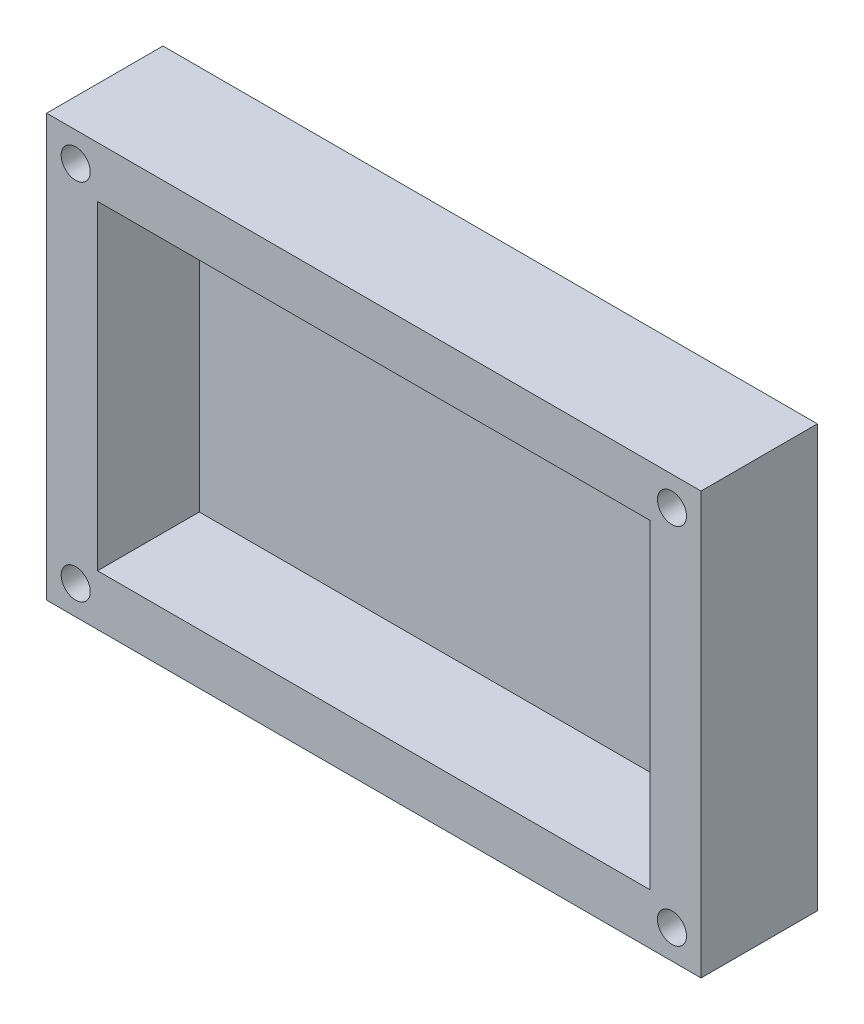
from build123d import *

# Parameters (mm, degrees)
SKETCH1_W           = 45
SKETCH1_H           = 29
BOSS_EXTRUDE1_DEPTH = 8
SKETCH2_W           = 38
SKETCH2_H           = 22
CUT_EXTRUDE1_DEPTH  = 7
SKETCH3_R           = 1
CUT_EXTRUDE2_DEPTH  = 7


with BuildPart() as part:
    # Sketch1 → Boss-Extrude1 (new body)
    with BuildSketch(Plane.XY):
        Rectangle(SKETCH1_W, SKETCH1_H)
    extrude(amount=BOSS_EXTRUDE1_DEPTH)

    # Sketch2 → Cut-Extrude1 (cut)
    with BuildSketch(Plane.XY.offset(8)):
        Rectangle(SKETCH2_W, SKETCH2_H)
    extrude(amount=-CUT_EXTRUDE1_DEPTH, mode=Mode.SUBTRACT)

    # Sketch3 → Cut-Extrude2 (cut)
    with BuildSketch(Plane.XY.offset(8)):
        with Locations((-20.5, 12.5)):
            Circle(SKETCH3_R)
        with Locations((-20.5, -12.5)):
            Circle(SKETCH3_R)
        with Locations((20.5, 12.5)):
            Circle(SKETCH3_R)
        with Locations((20.5, -12.5)):
            Circle(SKETCH3_R)
    extrude(amount=-CUT_EXTRUDE2_DEPTH, mode=Mode.SUBTRACT)


solid = part.part
